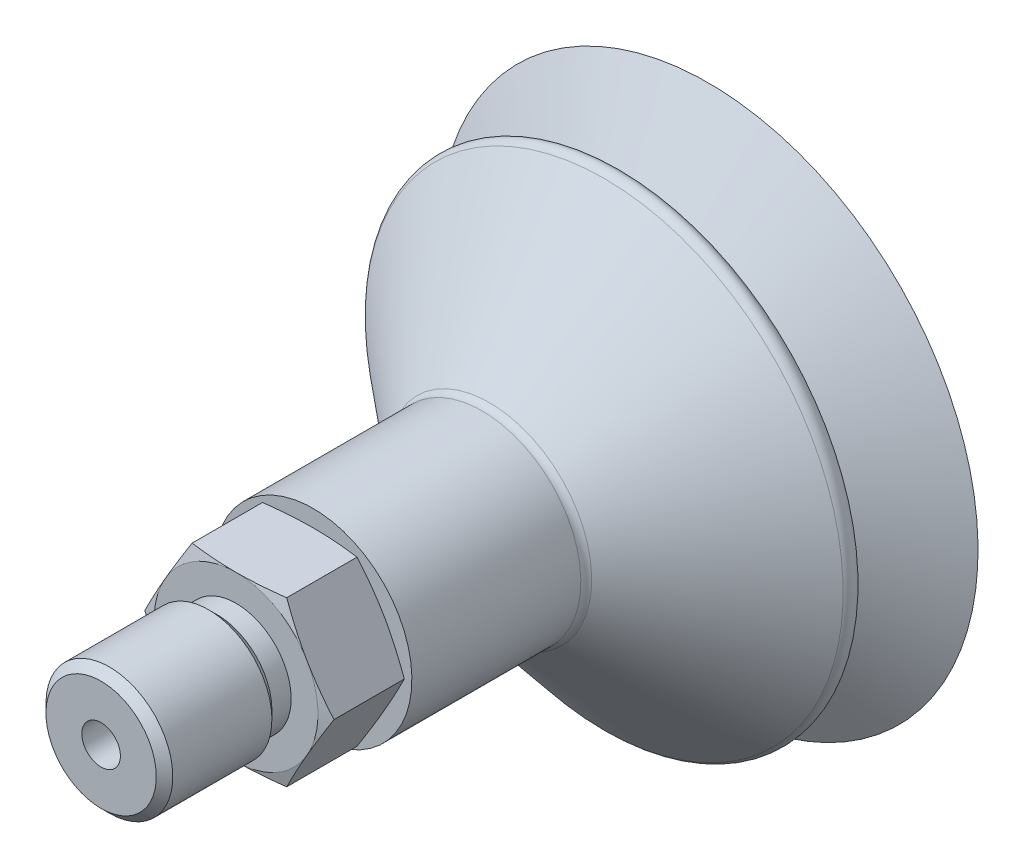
ISO-10303-21;
HEADER;
FILE_DESCRIPTION(('STEP AP214'),'2;1');
FILE_NAME('part.step','',(''),(''),'','','');
FILE_SCHEMA(('AUTOMOTIVE_DESIGN { 1 0 10303 214 1 1 1 1 }'));
ENDSEC;
DATA;
#1=APPLICATION_CONTEXT('core data for automotive mechanical design processes');
#2=APPLICATION_PROTOCOL_DEFINITION('international standard','automotive_design',2000,#1);
#3=PRODUCT_CONTEXT('',#1,'mechanical');
#4=PRODUCT('Part','Part','',(#3));
#5=PRODUCT_RELATED_PRODUCT_CATEGORY('part','',(#4));
#6=PRODUCT_DEFINITION_FORMATION('','',#4);
#7=PRODUCT_DEFINITION_CONTEXT('part definition',#1,'design');
#8=PRODUCT_DEFINITION('design','',#6,#7);
#9=PRODUCT_DEFINITION_SHAPE('','',#8);
#10=(LENGTH_UNIT() NAMED_UNIT(*) SI_UNIT(.MILLI.,.METRE.));
#11=(NAMED_UNIT(*) PLANE_ANGLE_UNIT() SI_UNIT($,.RADIAN.));
#12=(NAMED_UNIT(*) SI_UNIT($,.STERADIAN.) SOLID_ANGLE_UNIT());
#13=UNCERTAINTY_MEASURE_WITH_UNIT(LENGTH_MEASURE(1.E-05),#10,'distance_accuracy_value','');
#14=(GEOMETRIC_REPRESENTATION_CONTEXT(3) GLOBAL_UNCERTAINTY_ASSIGNED_CONTEXT((#13)) GLOBAL_UNIT_ASSIGNED_CONTEXT((#10,
#11,#12)) REPRESENTATION_CONTEXT('',''));
#15=CARTESIAN_POINT('',(0.,0.,0.));
#16=DIRECTION('',(0.,0.,1.));
#17=DIRECTION('',(1.,0.,0.));
#18=AXIS2_PLACEMENT_3D('',#15,#16,#17);
#19=CARTESIAN_POINT('',(9.81495457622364,0.,49.));
#20=DIRECTION('',(-0.866025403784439,-0.5,0.));
#21=DIRECTION('',(0.,0.,-1.));
#22=AXIS2_PLACEMENT_3D('',#19,#20,#21);
#23=PLANE('',#22);
#24=CARTESIAN_POINT('',(9.81495457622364,0.,41.3523410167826));
#25=CARTESIAN_POINT('',(8.50000000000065,2.27756813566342,41.));
#26=CARTESIAN_POINT('',(7.36121593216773,4.25,41.));
#27=B_SPLINE_CURVE_WITH_KNOTS('',2,(#24,#25,#26),.UNSPECIFIED.,.F.,.F.,(3,3),(0.,1.),.UNSPECIFIED.);
#28=CARTESIAN_POINT('',(9.81495457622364,0.,41.3523410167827));
#29=VERTEX_POINT('',#28);
#30=CARTESIAN_POINT('',(7.36121593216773,4.25,41.));
#31=VERTEX_POINT('',#30);
#32=EDGE_CURVE('E375',#29,#31,#27,.T.);
#33=ORIENTED_EDGE('',*,*,#32,.T.);
#34=CARTESIAN_POINT('',(7.36121593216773,4.25,41.));
#35=CARTESIAN_POINT('',(6.22243186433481,6.22243186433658,41.));
#36=CARTESIAN_POINT('',(4.90747728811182,8.5,41.3523410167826));
#37=B_SPLINE_CURVE_WITH_KNOTS('',2,(#34,#35,#36),.UNSPECIFIED.,.F.,.F.,(3,3),(0.,1.),.UNSPECIFIED.);
#38=CARTESIAN_POINT('',(4.90747728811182,8.5,41.3523410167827));
#39=VERTEX_POINT('',#38);
#40=EDGE_CURVE('E1022',#31,#39,#37,.T.);
#41=ORIENTED_EDGE('',*,*,#40,.T.);
#42=DIRECTION('',(0.,0.,-1.));
#43=VECTOR('',#42,1.);
#44=CARTESIAN_POINT('',(4.90747728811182,8.5,49.));
#45=LINE('',#44,#43);
#46=CARTESIAN_POINT('',(4.90747728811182,8.5,48.6476589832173));
#47=VERTEX_POINT('',#46);
#48=EDGE_CURVE('E10',#47,#39,#45,.T.);
#49=ORIENTED_EDGE('',*,*,#48,.F.);
#50=CARTESIAN_POINT('',(4.90747728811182,8.5,48.6476589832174));
#51=CARTESIAN_POINT('',(6.22243186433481,6.22243186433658,49.));
#52=CARTESIAN_POINT('',(7.36121593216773,4.25,49.));
#53=B_SPLINE_CURVE_WITH_KNOTS('',2,(#50,#51,#52),.UNSPECIFIED.,.F.,.F.,(3,3),(0.,1.),.UNSPECIFIED.);
#54=CARTESIAN_POINT('',(7.36121593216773,4.25,49.));
#55=VERTEX_POINT('',#54);
#56=EDGE_CURVE('E228',#47,#55,#53,.T.);
#57=ORIENTED_EDGE('',*,*,#56,.T.);
#58=CARTESIAN_POINT('',(7.36121593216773,4.25,49.));
#59=CARTESIAN_POINT('',(8.50000000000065,2.27756813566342,49.));
#60=CARTESIAN_POINT('',(9.81495457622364,0.,48.6476589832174));
#61=B_SPLINE_CURVE_WITH_KNOTS('',2,(#58,#59,#60),.UNSPECIFIED.,.F.,.F.,(3,3),(0.,1.),.UNSPECIFIED.);
#62=CARTESIAN_POINT('',(9.81495457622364,0.,48.6476589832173));
#63=VERTEX_POINT('',#62);
#64=EDGE_CURVE('E337',#55,#63,#61,.T.);
#65=ORIENTED_EDGE('',*,*,#64,.T.);
#66=DIRECTION('',(0.,0.,-1.));
#67=VECTOR('',#66,1.);
#68=CARTESIAN_POINT('',(9.81495457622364,0.,49.));
#69=LINE('',#68,#67);
#70=EDGE_CURVE('E275',#63,#29,#69,.T.);
#71=ORIENTED_EDGE('',*,*,#70,.T.);
#72=EDGE_LOOP('',(#33,#41,#49,#57,#65,#71));
#73=FACE_BOUND('',#72,.T.);
#74=ADVANCED_FACE('F15',(#73),#23,.F.);
#75=CARTESIAN_POINT('',(4.90747728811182,8.5,49.));
#76=DIRECTION('',(0.,-1.,0.));
#77=DIRECTION('',(0.,0.,-1.));
#78=AXIS2_PLACEMENT_3D('',#75,#76,#77);
#79=PLANE('',#78);
#80=CARTESIAN_POINT('',(4.90747728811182,8.5,41.3523410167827));
#81=CARTESIAN_POINT('',(2.27756813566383,8.5,41.));
#82=CARTESIAN_POINT('',(0.,8.5,41.));
#83=B_SPLINE_CURVE_WITH_KNOTS('',2,(#80,#81,#82),.UNSPECIFIED.,.F.,.F.,(3,3),(0.,1.),.UNSPECIFIED.);
#84=CARTESIAN_POINT('',(0.,8.5,41.));
#85=VERTEX_POINT('',#84);
#86=EDGE_CURVE('E248',#39,#85,#83,.T.);
#87=ORIENTED_EDGE('',*,*,#86,.T.);
#88=CARTESIAN_POINT('',(0.,8.5,41.));
#89=CARTESIAN_POINT('',(-2.27756813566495,8.5,41.));
#90=CARTESIAN_POINT('',(-4.90747728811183,8.5,41.3523410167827));
#91=B_SPLINE_CURVE_WITH_KNOTS('',2,(#88,#89,#90),.UNSPECIFIED.,.F.,.F.,(3,3),(0.,1.),.UNSPECIFIED.);
#92=CARTESIAN_POINT('',(-4.90747728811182,8.5,41.3523410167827));
#93=VERTEX_POINT('',#92);
#94=EDGE_CURVE('E431',#85,#93,#91,.T.);
#95=ORIENTED_EDGE('',*,*,#94,.T.);
#96=DIRECTION('',(0.,0.,-1.));
#97=VECTOR('',#96,1.);
#98=CARTESIAN_POINT('',(-4.90747728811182,8.5,49.));
#99=LINE('',#98,#97);
#100=CARTESIAN_POINT('',(-4.90747728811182,8.5,48.6476589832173));
#101=VERTEX_POINT('',#100);
#102=EDGE_CURVE('E28',#101,#93,#99,.T.);
#103=ORIENTED_EDGE('',*,*,#102,.F.);
#104=CARTESIAN_POINT('',(-4.90747728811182,8.5,48.6476589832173));
#105=CARTESIAN_POINT('',(-2.27756813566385,8.5,49.));
#106=CARTESIAN_POINT('',(0.,8.5,49.));
#107=B_SPLINE_CURVE_WITH_KNOTS('',2,(#104,#105,#106),.UNSPECIFIED.,.F.,.F.,(3,3),(0.,1.),.UNSPECIFIED.);
#108=CARTESIAN_POINT('',(0.,8.5,49.));
#109=VERTEX_POINT('',#108);
#110=EDGE_CURVE('E269',#101,#109,#107,.T.);
#111=ORIENTED_EDGE('',*,*,#110,.T.);
#112=CARTESIAN_POINT('',(0.,8.5,49.));
#113=CARTESIAN_POINT('',(2.27756813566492,8.5,49.));
#114=CARTESIAN_POINT('',(4.90747728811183,8.5,48.6476589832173));
#115=B_SPLINE_CURVE_WITH_KNOTS('',2,(#112,#113,#114),.UNSPECIFIED.,.F.,.F.,(3,3),(0.,1.),.UNSPECIFIED.);
#116=EDGE_CURVE('E1023',#109,#47,#115,.T.);
#117=ORIENTED_EDGE('',*,*,#116,.T.);
#118=ORIENTED_EDGE('',*,*,#48,.T.);
#119=EDGE_LOOP('',(#87,#95,#103,#111,#117,#118));
#120=FACE_BOUND('',#119,.T.);
#121=ADVANCED_FACE('F306',(#120),#79,.F.);
#122=CARTESIAN_POINT('',(-4.90747728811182,8.5,49.));
#123=DIRECTION('',(0.866025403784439,-0.5,0.));
#124=DIRECTION('',(0.5,0.866025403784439,0.));
#125=AXIS2_PLACEMENT_3D('',#122,#123,#124);
#126=PLANE('',#125);
#127=CARTESIAN_POINT('',(-4.90747728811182,8.5,41.3523410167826));
#128=CARTESIAN_POINT('',(-6.22243186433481,6.22243186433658,41.));
#129=CARTESIAN_POINT('',(-7.36121593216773,4.25,41.));
#130=B_SPLINE_CURVE_WITH_KNOTS('',2,(#127,#128,#129),.UNSPECIFIED.,.F.,.F.,(3,3),(0.,1.),.UNSPECIFIED.);
#131=CARTESIAN_POINT('',(-7.36121593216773,4.25,41.));
#132=VERTEX_POINT('',#131);
#133=EDGE_CURVE('E681',#93,#132,#130,.T.);
#134=ORIENTED_EDGE('',*,*,#133,.T.);
#135=CARTESIAN_POINT('',(-7.36121593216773,4.25,41.));
#136=CARTESIAN_POINT('',(-8.50000000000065,2.27756813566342,41.));
#137=CARTESIAN_POINT('',(-9.81495457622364,0.,41.3523410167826));
#138=B_SPLINE_CURVE_WITH_KNOTS('',2,(#135,#136,#137),.UNSPECIFIED.,.F.,.F.,(3,3),(0.,1.),.UNSPECIFIED.);
#139=CARTESIAN_POINT('',(-9.81495457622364,0.,41.3523410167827));
#140=VERTEX_POINT('',#139);
#141=EDGE_CURVE('E808',#132,#140,#138,.T.);
#142=ORIENTED_EDGE('',*,*,#141,.T.);
#143=DIRECTION('',(0.,0.,-1.));
#144=VECTOR('',#143,1.);
#145=CARTESIAN_POINT('',(-9.81495457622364,0.,49.));
#146=LINE('',#145,#144);
#147=CARTESIAN_POINT('',(-9.81495457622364,0.,48.6476589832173));
#148=VERTEX_POINT('',#147);
#149=EDGE_CURVE('E820',#148,#140,#146,.T.);
#150=ORIENTED_EDGE('',*,*,#149,.F.);
#151=CARTESIAN_POINT('',(-9.81495457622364,0.,48.6476589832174));
#152=CARTESIAN_POINT('',(-8.50000000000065,2.27756813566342,49.));
#153=CARTESIAN_POINT('',(-7.36121593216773,4.25,49.));
#154=B_SPLINE_CURVE_WITH_KNOTS('',2,(#151,#152,#153),.UNSPECIFIED.,.F.,.F.,(3,3),(0.,1.),.UNSPECIFIED.);
#155=CARTESIAN_POINT('',(-7.36121593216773,4.25,49.));
#156=VERTEX_POINT('',#155);
#157=EDGE_CURVE('E881',#148,#156,#154,.T.);
#158=ORIENTED_EDGE('',*,*,#157,.T.);
#159=CARTESIAN_POINT('',(-7.36121593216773,4.25,49.));
#160=CARTESIAN_POINT('',(-6.22243186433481,6.22243186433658,49.));
#161=CARTESIAN_POINT('',(-4.90747728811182,8.5,48.6476589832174));
#162=B_SPLINE_CURVE_WITH_KNOTS('',2,(#159,#160,#161),.UNSPECIFIED.,.F.,.F.,(3,3),(0.,1.),.UNSPECIFIED.);
#163=EDGE_CURVE('E522',#156,#101,#162,.T.);
#164=ORIENTED_EDGE('',*,*,#163,.T.);
#165=ORIENTED_EDGE('',*,*,#102,.T.);
#166=EDGE_LOOP('',(#134,#142,#150,#158,#164,#165));
#167=FACE_BOUND('',#166,.T.);
#168=ADVANCED_FACE('F447',(#167),#126,.F.);
#169=CARTESIAN_POINT('',(-9.81495457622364,0.,49.));
#170=DIRECTION('',(0.866025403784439,0.5,0.));
#171=DIRECTION('',(0.,0.,1.));
#172=AXIS2_PLACEMENT_3D('',#169,#170,#171);
#173=PLANE('',#172);
#174=CARTESIAN_POINT('',(-9.81495457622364,0.,41.3523410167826));
#175=CARTESIAN_POINT('',(-8.50000000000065,-2.27756813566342,41.));
#176=CARTESIAN_POINT('',(-7.36121593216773,-4.25,41.));
#177=B_SPLINE_CURVE_WITH_KNOTS('',2,(#174,#175,#176),.UNSPECIFIED.,.F.,.F.,(3,3),(0.,1.),.UNSPECIFIED.);
#178=CARTESIAN_POINT('',(-7.36121593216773,-4.25,41.));
#179=VERTEX_POINT('',#178);
#180=EDGE_CURVE('E575',#140,#179,#177,.T.);
#181=ORIENTED_EDGE('',*,*,#180,.T.);
#182=CARTESIAN_POINT('',(-7.36121593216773,-4.25,41.));
#183=CARTESIAN_POINT('',(-6.22243186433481,-6.22243186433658,41.));
#184=CARTESIAN_POINT('',(-4.90747728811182,-8.5,41.3523410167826));
#185=B_SPLINE_CURVE_WITH_KNOTS('',2,(#182,#183,#184),.UNSPECIFIED.,.F.,.F.,(3,3),(0.,1.),.UNSPECIFIED.);
#186=CARTESIAN_POINT('',(-4.90747728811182,-8.5,41.3523410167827));
#187=VERTEX_POINT('',#186);
#188=EDGE_CURVE('E804',#179,#187,#185,.T.);
#189=ORIENTED_EDGE('',*,*,#188,.T.);
#190=DIRECTION('',(0.,0.,-1.));
#191=VECTOR('',#190,1.);
#192=CARTESIAN_POINT('',(-4.90747728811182,-8.5,49.));
#193=LINE('',#192,#191);
#194=CARTESIAN_POINT('',(-4.90747728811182,-8.5,48.6476589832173));
#195=VERTEX_POINT('',#194);
#196=EDGE_CURVE('E811',#195,#187,#193,.T.);
#197=ORIENTED_EDGE('',*,*,#196,.F.);
#198=CARTESIAN_POINT('',(-4.90747728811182,-8.5,48.6476589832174));
#199=CARTESIAN_POINT('',(-6.22243186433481,-6.22243186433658,49.));
#200=CARTESIAN_POINT('',(-7.36121593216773,-4.25,49.));
#201=B_SPLINE_CURVE_WITH_KNOTS('',2,(#198,#199,#200),.UNSPECIFIED.,.F.,.F.,(3,3),(0.,1.),.UNSPECIFIED.);
#202=CARTESIAN_POINT('',(-7.36121593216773,-4.25,49.));
#203=VERTEX_POINT('',#202);
#204=EDGE_CURVE('E904',#195,#203,#201,.T.);
#205=ORIENTED_EDGE('',*,*,#204,.T.);
#206=CARTESIAN_POINT('',(-7.36121593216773,-4.25,49.));
#207=CARTESIAN_POINT('',(-8.50000000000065,-2.27756813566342,49.));
#208=CARTESIAN_POINT('',(-9.81495457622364,0.,48.6476589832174));
#209=B_SPLINE_CURVE_WITH_KNOTS('',2,(#206,#207,#208),.UNSPECIFIED.,.F.,.F.,(3,3),(0.,1.),.UNSPECIFIED.);
#210=EDGE_CURVE('E523',#203,#148,#209,.T.);
#211=ORIENTED_EDGE('',*,*,#210,.T.);
#212=ORIENTED_EDGE('',*,*,#149,.T.);
#213=EDGE_LOOP('',(#181,#189,#197,#205,#211,#212));
#214=FACE_BOUND('',#213,.T.);
#215=ADVANCED_FACE('F537',(#214),#173,.F.);
#216=CARTESIAN_POINT('',(-4.90747728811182,-8.5,49.));
#217=DIRECTION('',(0.,1.,0.));
#218=DIRECTION('',(-1.,0.,0.));
#219=AXIS2_PLACEMENT_3D('',#216,#217,#218);
#220=PLANE('',#219);
#221=CARTESIAN_POINT('',(-4.90747728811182,-8.5,41.3523410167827));
#222=CARTESIAN_POINT('',(-2.27756813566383,-8.5,41.));
#223=CARTESIAN_POINT('',(0.,-8.5,41.));
#224=B_SPLINE_CURVE_WITH_KNOTS('',2,(#221,#222,#223),.UNSPECIFIED.,.F.,.F.,(3,3),(0.,1.),.UNSPECIFIED.);
#225=CARTESIAN_POINT('',(0.,-8.5,41.));
#226=VERTEX_POINT('',#225);
#227=EDGE_CURVE('E611',#187,#226,#224,.T.);
#228=ORIENTED_EDGE('',*,*,#227,.T.);
#229=CARTESIAN_POINT('',(0.,-8.5,41.));
#230=CARTESIAN_POINT('',(2.27756813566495,-8.5,41.));
#231=CARTESIAN_POINT('',(4.90747728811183,-8.5,41.3523410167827));
#232=B_SPLINE_CURVE_WITH_KNOTS('',2,(#229,#230,#231),.UNSPECIFIED.,.F.,.F.,(3,3),(0.,1.),.UNSPECIFIED.);
#233=CARTESIAN_POINT('',(4.90747728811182,-8.5,41.3523410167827));
#234=VERTEX_POINT('',#233);
#235=EDGE_CURVE('E423',#226,#234,#232,.T.);
#236=ORIENTED_EDGE('',*,*,#235,.T.);
#237=DIRECTION('',(0.,0.,-1.));
#238=VECTOR('',#237,1.);
#239=CARTESIAN_POINT('',(4.90747728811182,-8.5,49.));
#240=LINE('',#239,#238);
#241=CARTESIAN_POINT('',(4.90747728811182,-8.5,48.6476589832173));
#242=VERTEX_POINT('',#241);
#243=EDGE_CURVE('E699',#242,#234,#240,.T.);
#244=ORIENTED_EDGE('',*,*,#243,.F.);
#245=CARTESIAN_POINT('',(4.90747728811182,-8.5,48.6476589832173));
#246=CARTESIAN_POINT('',(2.27756813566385,-8.5,49.));
#247=CARTESIAN_POINT('',(0.,-8.5,49.));
#248=B_SPLINE_CURVE_WITH_KNOTS('',2,(#245,#246,#247),.UNSPECIFIED.,.F.,.F.,(3,3),(0.,1.),.UNSPECIFIED.);
#249=CARTESIAN_POINT('',(0.,-8.5,49.));
#250=VERTEX_POINT('',#249);
#251=EDGE_CURVE('E949',#242,#250,#248,.T.);
#252=ORIENTED_EDGE('',*,*,#251,.T.);
#253=CARTESIAN_POINT('',(0.,-8.5,49.));
#254=CARTESIAN_POINT('',(-2.27756813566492,-8.5,49.));
#255=CARTESIAN_POINT('',(-4.90747728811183,-8.5,48.6476589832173));
#256=B_SPLINE_CURVE_WITH_KNOTS('',2,(#253,#254,#255),.UNSPECIFIED.,.F.,.F.,(3,3),(0.,1.),.UNSPECIFIED.);
#257=EDGE_CURVE('E905',#250,#195,#256,.T.);
#258=ORIENTED_EDGE('',*,*,#257,.T.);
#259=ORIENTED_EDGE('',*,*,#196,.T.);
#260=EDGE_LOOP('',(#228,#236,#244,#252,#258,#259));
#261=FACE_BOUND('',#260,.T.);
#262=ADVANCED_FACE('F448',(#261),#220,.F.);
#263=CARTESIAN_POINT('',(4.90747728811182,-8.5,49.));
#264=DIRECTION('',(-0.866025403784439,0.5,0.));
#265=DIRECTION('',(0.,0.,-1.));
#266=AXIS2_PLACEMENT_3D('',#263,#264,#265);
#267=PLANE('',#266);
#268=CARTESIAN_POINT('',(4.90747728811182,-8.5,41.3523410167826));
#269=CARTESIAN_POINT('',(6.22243186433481,-6.22243186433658,41.));
#270=CARTESIAN_POINT('',(7.36121593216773,-4.25,41.));
#271=B_SPLINE_CURVE_WITH_KNOTS('',2,(#268,#269,#270),.UNSPECIFIED.,.F.,.F.,(3,3),(0.,1.),.UNSPECIFIED.);
#272=CARTESIAN_POINT('',(7.36121593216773,-4.25,41.));
#273=VERTEX_POINT('',#272);
#274=EDGE_CURVE('E422',#234,#273,#271,.T.);
#275=ORIENTED_EDGE('',*,*,#274,.T.);
#276=CARTESIAN_POINT('',(7.36121593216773,-4.25,41.));
#277=CARTESIAN_POINT('',(8.50000000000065,-2.27756813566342,41.));
#278=CARTESIAN_POINT('',(9.81495457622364,0.,41.3523410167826));
#279=B_SPLINE_CURVE_WITH_KNOTS('',2,(#276,#277,#278),.UNSPECIFIED.,.F.,.F.,(3,3),(0.,1.),.UNSPECIFIED.);
#280=EDGE_CURVE('E400',#273,#29,#279,.T.);
#281=ORIENTED_EDGE('',*,*,#280,.T.);
#282=ORIENTED_EDGE('',*,*,#70,.F.);
#283=CARTESIAN_POINT('',(9.81495457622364,0.,48.6476589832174));
#284=CARTESIAN_POINT('',(8.50000000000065,-2.27756813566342,49.));
#285=CARTESIAN_POINT('',(7.36121593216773,-4.25,49.));
#286=B_SPLINE_CURVE_WITH_KNOTS('',2,(#283,#284,#285),.UNSPECIFIED.,.F.,.F.,(3,3),(0.,1.),.UNSPECIFIED.);
#287=CARTESIAN_POINT('',(7.36121593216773,-4.25,49.));
#288=VERTEX_POINT('',#287);
#289=EDGE_CURVE('E996',#63,#288,#286,.T.);
#290=ORIENTED_EDGE('',*,*,#289,.T.);
#291=CARTESIAN_POINT('',(7.36121593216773,-4.25,49.));
#292=CARTESIAN_POINT('',(6.22243186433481,-6.22243186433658,49.));
#293=CARTESIAN_POINT('',(4.90747728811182,-8.5,48.6476589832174));
#294=B_SPLINE_CURVE_WITH_KNOTS('',2,(#291,#292,#293),.UNSPECIFIED.,.F.,.F.,(3,3),(0.,1.),.UNSPECIFIED.);
#295=EDGE_CURVE('E950',#288,#242,#294,.T.);
#296=ORIENTED_EDGE('',*,*,#295,.T.);
#297=ORIENTED_EDGE('',*,*,#243,.T.);
#298=EDGE_LOOP('',(#275,#281,#282,#290,#296,#297));
#299=FACE_BOUND('',#298,.T.);
#300=ADVANCED_FACE('F309',(#299),#267,.F.);
#301=CARTESIAN_POINT('',(0.,0.,62.144));
#302=DIRECTION('',(0.,0.,-1.));
#303=DIRECTION('',(0.,-1.,0.));
#304=AXIS2_PLACEMENT_3D('',#301,#302,#303);
#305=CONICAL_SURFACE('',#304,6.5785,0.785398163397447);
#306=CARTESIAN_POINT('',(0.,0.,62.144));
#307=DIRECTION('',(0.,0.,-1.));
#308=DIRECTION('',(0.,-1.,0.));
#309=AXIS2_PLACEMENT_3D('',#306,#307,#308);
#310=CIRCLE('',#309,6.5785);
#311=CARTESIAN_POINT('',(0.,-6.5785,62.144));
#312=VERTEX_POINT('',#311);
#313=EDGE_CURVE('E40',#312,#312,#310,.T.);
#314=ORIENTED_EDGE('',*,*,#313,.F.);
#315=EDGE_LOOP('',(#314));
#316=FACE_BOUND('',#315,.T.);
#317=CARTESIAN_POINT('',(0.,0.,63.));
#318=DIRECTION('',(0.,0.,-1.));
#319=DIRECTION('',(0.,-1.,0.));
#320=AXIS2_PLACEMENT_3D('',#317,#318,#319);
#321=CIRCLE('',#320,5.7225);
#322=CARTESIAN_POINT('',(0.,-5.7225,63.));
#323=VERTEX_POINT('',#322);
#324=EDGE_CURVE('E245',#323,#323,#321,.T.);
#325=ORIENTED_EDGE('',*,*,#324,.T.);
#326=EDGE_LOOP('',(#325));
#327=FACE_BOUND('',#326,.T.);
#328=ADVANCED_FACE('F1582',(#316,#327),#305,.T.);
#329=CARTESIAN_POINT('',(0.,0.,41.));
#330=DIRECTION('',(0.,0.,-1.));
#331=DIRECTION('',(0.,-1.,0.));
#332=AXIS2_PLACEMENT_3D('',#329,#330,#331);
#333=CYLINDRICAL_SURFACE('',#332,6.5785);
#334=CARTESIAN_POINT('',(0.,0.,51.856));
#335=DIRECTION('',(0.,0.,-1.));
#336=DIRECTION('',(0.,-1.,0.));
#337=AXIS2_PLACEMENT_3D('',#334,#335,#336);
#338=CIRCLE('',#337,6.5785);
#339=CARTESIAN_POINT('',(0.,-6.5785,51.856));
#340=VERTEX_POINT('',#339);
#341=EDGE_CURVE('E253',#340,#340,#338,.T.);
#342=ORIENTED_EDGE('',*,*,#341,.F.);
#343=EDGE_LOOP('',(#342));
#344=FACE_BOUND('',#343,.T.);
#345=ORIENTED_EDGE('',*,*,#313,.T.);
#346=EDGE_LOOP('',(#345));
#347=FACE_BOUND('',#346,.T.);
#348=ADVANCED_FACE('F786',(#344,#347),#333,.T.);
#349=CARTESIAN_POINT('',(0.,0.,51.));
#350=DIRECTION('',(0.,0.,1.));
#351=DIRECTION('',(0.,1.,0.));
#352=AXIS2_PLACEMENT_3D('',#349,#350,#351);
#353=CONICAL_SURFACE('',#352,5.7225,0.785398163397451);
#354=CARTESIAN_POINT('',(0.,0.,51.));
#355=DIRECTION('',(0.,0.,-1.));
#356=DIRECTION('',(0.,-1.,0.));
#357=AXIS2_PLACEMENT_3D('',#354,#355,#356);
#358=CIRCLE('',#357,5.7225);
#359=CARTESIAN_POINT('',(0.,-5.7225,51.));
#360=VERTEX_POINT('',#359);
#361=EDGE_CURVE('E227',#360,#360,#358,.T.);
#362=ORIENTED_EDGE('',*,*,#361,.F.);
#363=EDGE_LOOP('',(#362));
#364=FACE_BOUND('',#363,.T.);
#365=ORIENTED_EDGE('',*,*,#341,.T.);
#366=EDGE_LOOP('',(#365));
#367=FACE_BOUND('',#366,.T.);
#368=ADVANCED_FACE('F1563',(#364,#367),#353,.T.);
#369=CARTESIAN_POINT('',(0.,0.,41.));
#370=DIRECTION('',(0.,0.,-1.));
#371=DIRECTION('',(0.,-1.,0.));
#372=AXIS2_PLACEMENT_3D('',#369,#370,#371);
#373=CYLINDRICAL_SURFACE('',#372,5.7225);
#374=CARTESIAN_POINT('',(0.,0.,49.));
#375=DIRECTION('',(0.,0.,-1.));
#376=DIRECTION('',(0.,-1.,0.));
#377=AXIS2_PLACEMENT_3D('',#374,#375,#376);
#378=CIRCLE('',#377,5.7225);
#379=CARTESIAN_POINT('',(0.,-5.7225,49.));
#380=VERTEX_POINT('',#379);
#381=EDGE_CURVE('E224',#380,#380,#378,.T.);
#382=ORIENTED_EDGE('',*,*,#381,.F.);
#383=EDGE_LOOP('',(#382));
#384=FACE_BOUND('',#383,.T.);
#385=ORIENTED_EDGE('',*,*,#361,.T.);
#386=EDGE_LOOP('',(#385));
#387=FACE_BOUND('',#386,.T.);
#388=ADVANCED_FACE('F1553',(#384,#387),#373,.T.);
#389=CARTESIAN_POINT('',(-8.5,0.,49.));
#390=DIRECTION('',(0.,0.,1.));
#391=DIRECTION('',(-1.,0.,0.));
#392=AXIS2_PLACEMENT_3D('',#389,#390,#391);
#393=PLANE('',#392);
#394=CARTESIAN_POINT('',(0.,0.,49.));
#395=DIRECTION('',(0.,0.,-1.));
#396=DIRECTION('',(0.,-1.,0.));
#397=AXIS2_PLACEMENT_3D('',#394,#395,#396);
#398=CIRCLE('',#397,8.5);
#399=EDGE_CURVE('E513',#203,#156,#398,.T.);
#400=ORIENTED_EDGE('',*,*,#399,.F.);
#401=CARTESIAN_POINT('',(0.,0.,49.));
#402=DIRECTION('',(0.,0.,-1.));
#403=DIRECTION('',(0.,-1.,0.));
#404=AXIS2_PLACEMENT_3D('',#401,#402,#403);
#405=CIRCLE('',#404,8.5);
#406=EDGE_CURVE('E895',#250,#203,#405,.T.);
#407=ORIENTED_EDGE('',*,*,#406,.F.);
#408=CARTESIAN_POINT('',(0.,0.,49.));
#409=DIRECTION('',(0.,0.,-1.));
#410=DIRECTION('',(0.,-1.,0.));
#411=AXIS2_PLACEMENT_3D('',#408,#409,#410);
#412=CIRCLE('',#411,8.5);
#413=EDGE_CURVE('E940',#288,#250,#412,.T.);
#414=ORIENTED_EDGE('',*,*,#413,.F.);
#415=CARTESIAN_POINT('',(0.,0.,49.));
#416=DIRECTION('',(0.,0.,-1.));
#417=DIRECTION('',(0.,-1.,0.));
#418=AXIS2_PLACEMENT_3D('',#415,#416,#417);
#419=CIRCLE('',#418,8.5);
#420=EDGE_CURVE('E994',#55,#288,#419,.T.);
#421=ORIENTED_EDGE('',*,*,#420,.F.);
#422=CARTESIAN_POINT('',(0.,0.,49.));
#423=DIRECTION('',(0.,0.,-1.));
#424=DIRECTION('',(0.,-1.,0.));
#425=AXIS2_PLACEMENT_3D('',#422,#423,#424);
#426=CIRCLE('',#425,8.5);
#427=EDGE_CURVE('E1025',#109,#55,#426,.T.);
#428=ORIENTED_EDGE('',*,*,#427,.F.);
#429=CARTESIAN_POINT('',(0.,0.,49.));
#430=DIRECTION('',(0.,0.,-1.));
#431=DIRECTION('',(0.,-1.,0.));
#432=AXIS2_PLACEMENT_3D('',#429,#430,#431);
#433=CIRCLE('',#432,8.5);
#434=EDGE_CURVE('E1080',#156,#109,#433,.T.);
#435=ORIENTED_EDGE('',*,*,#434,.F.);
#436=EDGE_LOOP('',(#400,#407,#414,#421,#428,#435));
#437=FACE_BOUND('',#436,.T.);
#438=ORIENTED_EDGE('',*,*,#381,.T.);
#439=EDGE_LOOP('',(#438));
#440=FACE_BOUND('',#439,.T.);
#441=ADVANCED_FACE('F654',(#437,#440),#393,.T.);
#442=CARTESIAN_POINT('',(0.,0.,48.5444863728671));
#443=DIRECTION('',(0.,0.,-1.));
#444=DIRECTION('',(0.,-1.,0.));
#445=AXIS2_PLACEMENT_3D('',#442,#443,#444);
#446=CONICAL_SURFACE('',#445,10.2,1.30899693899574);
#447=ORIENTED_EDGE('',*,*,#116,.F.);
#448=ORIENTED_EDGE('',*,*,#427,.T.);
#449=ORIENTED_EDGE('',*,*,#56,.F.);
#450=EDGE_LOOP('',(#447,#448,#449));
#451=FACE_BOUND('',#450,.T.);
#452=ADVANCED_FACE('F592',(#451),#446,.T.);
#453=CARTESIAN_POINT('',(0.,0.,41.));
#454=DIRECTION('',(0.,0.,1.));
#455=DIRECTION('',(0.,1.,0.));
#456=AXIS2_PLACEMENT_3D('',#453,#454,#455);
#457=CONICAL_SURFACE('',#456,8.5,1.30899693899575);
#458=ORIENTED_EDGE('',*,*,#86,.F.);
#459=ORIENTED_EDGE('',*,*,#40,.F.);
#460=CARTESIAN_POINT('',(0.,0.,41.));
#461=DIRECTION('',(0.,0.,-1.));
#462=DIRECTION('',(0.,-1.,0.));
#463=AXIS2_PLACEMENT_3D('',#460,#461,#462);
#464=CIRCLE('',#463,8.5);
#465=EDGE_CURVE('E207',#85,#31,#464,.T.);
#466=ORIENTED_EDGE('',*,*,#465,.F.);
#467=EDGE_LOOP('',(#458,#459,#466));
#468=FACE_BOUND('',#467,.T.);
#469=ADVANCED_FACE('F648',(#468),#457,.T.);
#470=CARTESIAN_POINT('',(0.,0.,41.));
#471=DIRECTION('',(0.,0.,-1.));
#472=DIRECTION('',(0.,-1.,0.));
#473=AXIS2_PLACEMENT_3D('',#470,#471,#472);
#474=CYLINDRICAL_SURFACE('',#473,2.);
#475=CARTESIAN_POINT('',(0.,0.,63.));
#476=DIRECTION('',(0.,0.,-1.));
#477=DIRECTION('',(0.,-1.,0.));
#478=AXIS2_PLACEMENT_3D('',#475,#476,#477);
#479=CIRCLE('',#478,2.);
#480=CARTESIAN_POINT('',(0.,-2.,63.));
#481=VERTEX_POINT('',#480);
#482=EDGE_CURVE('E249',#481,#481,#479,.T.);
#483=ORIENTED_EDGE('',*,*,#482,.F.);
#484=EDGE_LOOP('',(#483));
#485=FACE_BOUND('',#484,.T.);
#486=CARTESIAN_POINT('',(0.,0.,41.));
#487=DIRECTION('',(0.,0.,-1.));
#488=DIRECTION('',(0.,-1.,0.));
#489=AXIS2_PLACEMENT_3D('',#486,#487,#488);
#490=CIRCLE('',#489,2.);
#491=CARTESIAN_POINT('',(0.,-2.,41.));
#492=VERTEX_POINT('',#491);
#493=EDGE_CURVE('E216',#492,#492,#490,.T.);
#494=ORIENTED_EDGE('',*,*,#493,.T.);
#495=EDGE_LOOP('',(#494));
#496=FACE_BOUND('',#495,.T.);
#497=ADVANCED_FACE('F645',(#485,#496),#474,.F.);
#498=CARTESIAN_POINT('',(-5.7225,0.,63.));
#499=DIRECTION('',(0.,0.,1.));
#500=DIRECTION('',(-1.,0.,0.));
#501=AXIS2_PLACEMENT_3D('',#498,#499,#500);
#502=PLANE('',#501);
#503=ORIENTED_EDGE('',*,*,#324,.F.);
#504=EDGE_LOOP('',(#503));
#505=FACE_BOUND('',#504,.T.);
#506=ORIENTED_EDGE('',*,*,#482,.T.);
#507=EDGE_LOOP('',(#506));
#508=FACE_BOUND('',#507,.T.);
#509=ADVANCED_FACE('F549',(#505,#508),#502,.T.);
#510=CARTESIAN_POINT('',(-2.,0.,41.));
#511=DIRECTION('',(0.,0.,-1.));
#512=DIRECTION('',(0.,-1.,0.));
#513=AXIS2_PLACEMENT_3D('',#510,#511,#512);
#514=PLANE('',#513);
#515=ORIENTED_EDGE('',*,*,#493,.F.);
#516=EDGE_LOOP('',(#515));
#517=FACE_BOUND('',#516,.T.);
#518=CARTESIAN_POINT('',(0.,0.,41.));
#519=DIRECTION('',(0.,0.,-1.));
#520=DIRECTION('',(0.,-1.,0.));
#521=AXIS2_PLACEMENT_3D('',#518,#519,#520);
#522=CIRCLE('',#521,5.5);
#523=CARTESIAN_POINT('',(0.,-5.5,41.));
#524=VERTEX_POINT('',#523);
#525=EDGE_CURVE('E268',#524,#524,#522,.T.);
#526=ORIENTED_EDGE('',*,*,#525,.T.);
#527=EDGE_LOOP('',(#526));
#528=FACE_BOUND('',#527,.T.);
#529=ADVANCED_FACE('F842',(#517,#528),#514,.T.);
#530=CARTESIAN_POINT('',(-10.25,0.,41.));
#531=DIRECTION('',(0.,0.,1.));
#532=DIRECTION('',(-1.,0.,0.));
#533=AXIS2_PLACEMENT_3D('',#530,#531,#532);
#534=PLANE('',#533);
#535=CARTESIAN_POINT('',(0.,0.,41.));
#536=DIRECTION('',(0.,0.,-1.));
#537=DIRECTION('',(0.,-1.,0.));
#538=AXIS2_PLACEMENT_3D('',#535,#536,#537);
#539=CIRCLE('',#538,10.25);
#540=CARTESIAN_POINT('',(0.,-10.25,41.));
#541=VERTEX_POINT('',#540);
#542=EDGE_CURVE('E203',#541,#541,#539,.T.);
#543=ORIENTED_EDGE('',*,*,#542,.F.);
#544=EDGE_LOOP('',(#543));
#545=FACE_BOUND('',#544,.T.);
#546=CARTESIAN_POINT('',(0.,0.,41.));
#547=DIRECTION('',(0.,0.,-1.));
#548=DIRECTION('',(0.,-1.,0.));
#549=AXIS2_PLACEMENT_3D('',#546,#547,#548);
#550=CIRCLE('',#549,8.5);
#551=EDGE_CURVE('E707',#226,#179,#550,.T.);
#552=ORIENTED_EDGE('',*,*,#551,.T.);
#553=CARTESIAN_POINT('',(0.,0.,41.));
#554=DIRECTION('',(0.,0.,-1.));
#555=DIRECTION('',(0.,-1.,0.));
#556=AXIS2_PLACEMENT_3D('',#553,#554,#555);
#557=CIRCLE('',#556,8.5);
#558=EDGE_CURVE('E821',#179,#132,#557,.T.);
#559=ORIENTED_EDGE('',*,*,#558,.T.);
#560=CARTESIAN_POINT('',(0.,0.,41.));
#561=DIRECTION('',(0.,0.,-1.));
#562=DIRECTION('',(0.,-1.,0.));
#563=AXIS2_PLACEMENT_3D('',#560,#561,#562);
#564=CIRCLE('',#563,8.5);
#565=EDGE_CURVE('E664',#132,#85,#564,.T.);
#566=ORIENTED_EDGE('',*,*,#565,.T.);
#567=ORIENTED_EDGE('',*,*,#465,.T.);
#568=CARTESIAN_POINT('',(0.,0.,41.));
#569=DIRECTION('',(0.,0.,-1.));
#570=DIRECTION('',(0.,-1.,0.));
#571=AXIS2_PLACEMENT_3D('',#568,#569,#570);
#572=CIRCLE('',#571,8.5);
#573=EDGE_CURVE('E679',#31,#273,#572,.T.);
#574=ORIENTED_EDGE('',*,*,#573,.T.);
#575=CARTESIAN_POINT('',(0.,0.,41.));
#576=DIRECTION('',(0.,0.,-1.));
#577=DIRECTION('',(0.,-1.,0.));
#578=AXIS2_PLACEMENT_3D('',#575,#576,#577);
#579=CIRCLE('',#578,8.5);
#580=EDGE_CURVE('E413',#273,#226,#579,.T.);
#581=ORIENTED_EDGE('',*,*,#580,.T.);
#582=EDGE_LOOP('',(#552,#559,#566,#567,#574,#581));
#583=FACE_BOUND('',#582,.T.);
#584=ADVANCED_FACE('F357',(#545,#583),#534,.T.);
#585=CARTESIAN_POINT('',(0.,0.,0.));
#586=DIRECTION('',(0.,0.,-1.));
#587=DIRECTION('',(0.,-1.,0.));
#588=AXIS2_PLACEMENT_3D('',#585,#586,#587);
#589=CYLINDRICAL_SURFACE('',#588,10.25);
#590=CARTESIAN_POINT('',(0.,0.,23.466307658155));
#591=DIRECTION('',(0.,0.,-1.));
#592=DIRECTION('',(0.,-1.,0.));
#593=AXIS2_PLACEMENT_3D('',#590,#591,#592);
#594=CIRCLE('',#593,10.25);
#595=CARTESIAN_POINT('',(0.,-10.25,23.466307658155));
#596=VERTEX_POINT('',#595);
#597=EDGE_CURVE('E208',#596,#596,#594,.T.);
#598=ORIENTED_EDGE('',*,*,#597,.F.);
#599=EDGE_LOOP('',(#598));
#600=FACE_BOUND('',#599,.T.);
#601=ORIENTED_EDGE('',*,*,#542,.T.);
#602=EDGE_LOOP('',(#601));
#603=FACE_BOUND('',#602,.T.);
#604=ADVANCED_FACE('F204',(#600,#603),#589,.T.);
#605=CARTESIAN_POINT('',(0.,0.,23.466307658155));
#606=DIRECTION('',(0.,0.,-1.));
#607=DIRECTION('',(0.,-1.,0.));
#608=AXIS2_PLACEMENT_3D('',#605,#606,#607);
#609=TOROIDAL_SURFACE('',#608,11.25,1.);
#610=ORIENTED_EDGE('',*,*,#597,.T.);
#611=EDGE_LOOP('',(#610));
#612=FACE_BOUND('',#611,.T.);
#613=CARTESIAN_POINT('',(0.,0.,22.700263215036));
#614=DIRECTION('',(0.,0.,-1.));
#615=DIRECTION('',(0.,-1.,0.));
#616=AXIS2_PLACEMENT_3D('',#613,#614,#615);
#617=CIRCLE('',#616,10.6072123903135);
#618=CARTESIAN_POINT('',(0.,-10.6072123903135,22.700263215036));
#619=VERTEX_POINT('',#618);
#620=EDGE_CURVE('E219',#619,#619,#617,.T.);
#621=ORIENTED_EDGE('',*,*,#620,.F.);
#622=EDGE_LOOP('',(#621));
#623=FACE_BOUND('',#622,.T.);
#624=ADVANCED_FACE('F639',(#612,#623),#609,.F.);
#625=CARTESIAN_POINT('',(0.,0.,10.7931552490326));
#626=DIRECTION('',(0.,0.,-1.));
#627=DIRECTION('',(0.,-1.,0.));
#628=AXIS2_PLACEMENT_3D('',#625,#626,#627);
#629=CONICAL_SURFACE('',#628,24.7975510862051,0.872664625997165);
#630=CARTESIAN_POINT('',(0.,0.,10.7931552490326));
#631=DIRECTION('',(0.,0.,-1.));
#632=DIRECTION('',(0.,-1.,0.));
#633=AXIS2_PLACEMENT_3D('',#630,#631,#632);
#634=CIRCLE('',#633,24.7975510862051);
#635=CARTESIAN_POINT('',(0.,-24.7975510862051,10.7931552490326));
#636=VERTEX_POINT('',#635);
#637=EDGE_CURVE('E244',#636,#636,#634,.T.);
#638=ORIENTED_EDGE('',*,*,#637,.F.);
#639=EDGE_LOOP('',(#638));
#640=FACE_BOUND('',#639,.T.);
#641=ORIENTED_EDGE('',*,*,#620,.T.);
#642=EDGE_LOOP('',(#641));
#643=FACE_BOUND('',#642,.T.);
#644=ADVANCED_FACE('F643',(#640,#643),#629,.T.);
#645=CARTESIAN_POINT('',(0.,0.,10.0271108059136));
#646=DIRECTION('',(0.,0.,-1.));
#647=DIRECTION('',(0.,-1.,0.));
#648=AXIS2_PLACEMENT_3D('',#645,#646,#647);
#649=TOROIDAL_SURFACE('',#648,24.1547634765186,1.);
#650=CARTESIAN_POINT('',(0.,0.,9.12080301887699));
#651=DIRECTION('',(0.,0.,-1.));
#652=DIRECTION('',(0.,-1.,0.));
#653=AXIS2_PLACEMENT_3D('',#650,#651,#652);
#654=CIRCLE('',#653,24.5773817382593);
#655=CARTESIAN_POINT('',(0.,-24.5773817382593,9.12080301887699));
#656=VERTEX_POINT('',#655);
#657=EDGE_CURVE('E239',#656,#656,#654,.T.);
#658=ORIENTED_EDGE('',*,*,#657,.F.);
#659=EDGE_LOOP('',(#658));
#660=FACE_BOUND('',#659,.T.);
#661=ORIENTED_EDGE('',*,*,#637,.T.);
#662=EDGE_LOOP('',(#661));
#663=FACE_BOUND('',#662,.T.);
#664=ADVANCED_FACE('F1177',(#660,#663),#649,.T.);
#665=CARTESIAN_POINT('',(0.,0.,6.33443936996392));
#666=DIRECTION('',(0.,0.,1.));
#667=DIRECTION('',(0.,1.,0.));
#668=AXIS2_PLACEMENT_3D('',#665,#666,#667);
#669=CONICAL_SURFACE('',#668,18.6020056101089,1.13446401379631);
#670=CARTESIAN_POINT('',(0.,0.,6.33443936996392));
#671=DIRECTION('',(0.,0.,-1.));
#672=DIRECTION('',(0.,-1.,0.));
#673=AXIS2_PLACEMENT_3D('',#670,#671,#672);
#674=CIRCLE('',#673,18.6020056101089);
#675=CARTESIAN_POINT('',(0.,-18.6020056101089,6.33443936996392));
#676=VERTEX_POINT('',#675);
#677=EDGE_CURVE('E235',#676,#676,#674,.T.);
#678=ORIENTED_EDGE('',*,*,#677,.F.);
#679=EDGE_LOOP('',(#678));
#680=FACE_BOUND('',#679,.T.);
#681=ORIENTED_EDGE('',*,*,#657,.T.);
#682=EDGE_LOOP('',(#681));
#683=FACE_BOUND('',#682,.T.);
#684=ADVANCED_FACE('F843',(#680,#683),#669,.T.);
#685=CARTESIAN_POINT('',(0.,0.,5.8812854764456));
#686=DIRECTION('',(0.,0.,-1.));
#687=DIRECTION('',(0.,-1.,0.));
#688=AXIS2_PLACEMENT_3D('',#685,#686,#687);
#689=TOROIDAL_SURFACE('',#688,18.8133147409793,0.5);
#690=ORIENTED_EDGE('',*,*,#677,.T.);
#691=EDGE_LOOP('',(#690));
#692=FACE_BOUND('',#691,.T.);
#693=CARTESIAN_POINT('',(0.,0.,5.44827277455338));
#694=DIRECTION('',(0.,0.,-1.));
#695=DIRECTION('',(0.,-1.,0.));
#696=AXIS2_PLACEMENT_3D('',#693,#694,#695);
#697=CIRCLE('',#696,18.5633147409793);
#698=CARTESIAN_POINT('',(0.,-18.5633147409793,5.44827277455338));
#699=VERTEX_POINT('',#698);
#700=EDGE_CURVE('E240',#699,#699,#697,.T.);
#701=ORIENTED_EDGE('',*,*,#700,.F.);
#702=EDGE_LOOP('',(#701));
#703=FACE_BOUND('',#702,.T.);
#704=ADVANCED_FACE('F637',(#692,#703),#689,.F.);
#705=CARTESIAN_POINT('',(0.,0.,0.));
#706=DIRECTION('',(0.,0.,-1.));
#707=DIRECTION('',(0.,-1.,0.));
#708=AXIS2_PLACEMENT_3D('',#705,#706,#707);
#709=CONICAL_SURFACE('',#708,28.,1.0471975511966);
#710=CARTESIAN_POINT('',(0.,0.,0.));
#711=DIRECTION('',(0.,0.,-1.));
#712=DIRECTION('',(0.,-1.,0.));
#713=AXIS2_PLACEMENT_3D('',#710,#711,#712);
#714=CIRCLE('',#713,28.);
#715=CARTESIAN_POINT('',(0.,-28.,0.));
#716=VERTEX_POINT('',#715);
#717=EDGE_CURVE('E263',#716,#716,#714,.T.);
#718=ORIENTED_EDGE('',*,*,#717,.F.);
#719=EDGE_LOOP('',(#718));
#720=FACE_BOUND('',#719,.T.);
#721=ORIENTED_EDGE('',*,*,#700,.T.);
#722=EDGE_LOOP('',(#721));
#723=FACE_BOUND('',#722,.T.);
#724=ADVANCED_FACE('F504',(#720,#723),#709,.T.);
#725=CARTESIAN_POINT('',(-25.6866852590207,0.,0.));
#726=DIRECTION('',(0.,0.,-1.));
#727=DIRECTION('',(0.,-1.,0.));
#728=AXIS2_PLACEMENT_3D('',#725,#726,#727);
#729=PLANE('',#728);
#730=CARTESIAN_POINT('',(0.,0.,0.));
#731=DIRECTION('',(0.,0.,-1.));
#732=DIRECTION('',(0.,-1.,0.));
#733=AXIS2_PLACEMENT_3D('',#730,#731,#732);
#734=CIRCLE('',#733,25.6866852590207);
#735=CARTESIAN_POINT('',(0.,-25.6866852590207,0.));
#736=VERTEX_POINT('',#735);
#737=EDGE_CURVE('E233',#736,#736,#734,.T.);
#738=ORIENTED_EDGE('',*,*,#737,.F.);
#739=EDGE_LOOP('',(#738));
#740=FACE_BOUND('',#739,.T.);
#741=ORIENTED_EDGE('',*,*,#717,.T.);
#742=EDGE_LOOP('',(#741));
#743=FACE_BOUND('',#742,.T.);
#744=ADVANCED_FACE('F739',(#740,#743),#729,.T.);
#745=CARTESIAN_POINT('',(0.,0.,5.44827277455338));
#746=DIRECTION('',(0.,0.,-1.));
#747=DIRECTION('',(0.,-1.,0.));
#748=AXIS2_PLACEMENT_3D('',#745,#746,#747);
#749=CONICAL_SURFACE('',#748,16.25,1.0471975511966);
#750=CARTESIAN_POINT('',(0.,0.,5.44827277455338));
#751=DIRECTION('',(0.,0.,-1.));
#752=DIRECTION('',(0.,-1.,0.));
#753=AXIS2_PLACEMENT_3D('',#750,#751,#752);
#754=CIRCLE('',#753,16.25);
#755=CARTESIAN_POINT('',(0.,-16.25,5.44827277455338));
#756=VERTEX_POINT('',#755);
#757=EDGE_CURVE('E229',#756,#756,#754,.T.);
#758=ORIENTED_EDGE('',*,*,#757,.F.);
#759=EDGE_LOOP('',(#758));
#760=FACE_BOUND('',#759,.T.);
#761=ORIENTED_EDGE('',*,*,#737,.T.);
#762=EDGE_LOOP('',(#761));
#763=FACE_BOUND('',#762,.T.);
#764=ADVANCED_FACE('F307',(#760,#763),#749,.F.);
#765=CARTESIAN_POINT('',(0.,0.,5.8812854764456));
#766=DIRECTION('',(0.,0.,-1.));
#767=DIRECTION('',(0.,-1.,0.));
#768=AXIS2_PLACEMENT_3D('',#765,#766,#767);
#769=TOROIDAL_SURFACE('',#768,16.5,0.5);
#770=CARTESIAN_POINT('',(0.,0.,6.33443936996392));
#771=DIRECTION('',(0.,0.,-1.));
#772=DIRECTION('',(0.,-1.,0.));
#773=AXIS2_PLACEMENT_3D('',#770,#771,#772);
#774=CIRCLE('',#773,16.2886908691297);
#775=CARTESIAN_POINT('',(0.,-16.2886908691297,6.33443936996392));
#776=VERTEX_POINT('',#775);
#777=EDGE_CURVE('E234',#776,#776,#774,.T.);
#778=ORIENTED_EDGE('',*,*,#777,.F.);
#779=EDGE_LOOP('',(#778));
#780=FACE_BOUND('',#779,.T.);
#781=ORIENTED_EDGE('',*,*,#757,.T.);
#782=EDGE_LOOP('',(#781));
#783=FACE_BOUND('',#782,.T.);
#784=ADVANCED_FACE('F735',(#780,#783),#769,.T.);
#785=CARTESIAN_POINT('',(0.,0.,9.12080301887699));
#786=DIRECTION('',(0.,0.,1.));
#787=DIRECTION('',(0.,1.,0.));
#788=AXIS2_PLACEMENT_3D('',#785,#786,#787);
#789=CONICAL_SURFACE('',#788,22.26406699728,1.13446401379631);
#790=CARTESIAN_POINT('',(0.,0.,9.12080301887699));
#791=DIRECTION('',(0.,0.,-1.));
#792=DIRECTION('',(0.,-1.,0.));
#793=AXIS2_PLACEMENT_3D('',#790,#791,#792);
#794=CIRCLE('',#793,22.26406699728);
#795=CARTESIAN_POINT('',(0.,-22.26406699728,9.12080301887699));
#796=VERTEX_POINT('',#795);
#797=EDGE_CURVE('E252',#796,#796,#794,.T.);
#798=ORIENTED_EDGE('',*,*,#797,.F.);
#799=EDGE_LOOP('',(#798));
#800=FACE_BOUND('',#799,.T.);
#801=ORIENTED_EDGE('',*,*,#777,.T.);
#802=EDGE_LOOP('',(#801));
#803=FACE_BOUND('',#802,.T.);
#804=ADVANCED_FACE('F773',(#800,#803),#789,.F.);
#805=CARTESIAN_POINT('',(0.,0.,10.0271108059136));
#806=DIRECTION('',(0.,0.,-1.));
#807=DIRECTION('',(0.,-1.,0.));
#808=AXIS2_PLACEMENT_3D('',#805,#806,#807);
#809=TOROIDAL_SURFACE('',#808,21.8414487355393,1.);
#810=ORIENTED_EDGE('',*,*,#797,.T.);
#811=EDGE_LOOP('',(#810));
#812=FACE_BOUND('',#811,.T.);
#813=CARTESIAN_POINT('',(0.,0.,10.7931552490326));
#814=DIRECTION('',(0.,0.,-1.));
#815=DIRECTION('',(0.,-1.,0.));
#816=AXIS2_PLACEMENT_3D('',#813,#814,#815);
#817=CIRCLE('',#816,22.4842363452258);
#818=CARTESIAN_POINT('',(0.,-22.4842363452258,10.7931552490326));
#819=VERTEX_POINT('',#818);
#820=EDGE_CURVE('E276',#819,#819,#817,.T.);
#821=ORIENTED_EDGE('',*,*,#820,.F.);
#822=EDGE_LOOP('',(#821));
#823=FACE_BOUND('',#822,.T.);
#824=ADVANCED_FACE('F769',(#812,#823),#809,.F.);
#825=CARTESIAN_POINT('',(0.,0.,20.849123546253));
#826=DIRECTION('',(0.,0.,-1.));
#827=DIRECTION('',(0.,-1.,0.));
#828=AXIS2_PLACEMENT_3D('',#825,#826,#827);
#829=CONICAL_SURFACE('',#828,10.5,0.872664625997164);
#830=CARTESIAN_POINT('',(0.,0.,20.849123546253));
#831=DIRECTION('',(0.,0.,-1.));
#832=DIRECTION('',(0.,-1.,0.));
#833=AXIS2_PLACEMENT_3D('',#830,#831,#832);
#834=CIRCLE('',#833,10.5);
#835=CARTESIAN_POINT('',(0.,-10.5,20.849123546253));
#836=VERTEX_POINT('',#835);
#837=EDGE_CURVE('E261',#836,#836,#834,.T.);
#838=ORIENTED_EDGE('',*,*,#837,.F.);
#839=EDGE_LOOP('',(#838));
#840=FACE_BOUND('',#839,.T.);
#841=ORIENTED_EDGE('',*,*,#820,.T.);
#842=EDGE_LOOP('',(#841));
#843=FACE_BOUND('',#842,.T.);
#844=ADVANCED_FACE('F17',(#840,#843),#829,.F.);
#845=CARTESIAN_POINT('',(0.,0.,0.));
#846=DIRECTION('',(0.,0.,-1.));
#847=DIRECTION('',(0.,-1.,0.));
#848=AXIS2_PLACEMENT_3D('',#845,#846,#847);
#849=CYLINDRICAL_SURFACE('',#848,10.5);
#850=CARTESIAN_POINT('',(0.,0.,20.));
#851=DIRECTION('',(0.,0.,-1.));
#852=DIRECTION('',(0.,-1.,0.));
#853=AXIS2_PLACEMENT_3D('',#850,#851,#852);
#854=CIRCLE('',#853,10.5);
#855=CARTESIAN_POINT('',(0.,-10.5,20.));
#856=VERTEX_POINT('',#855);
#857=EDGE_CURVE('E258',#856,#856,#854,.T.);
#858=ORIENTED_EDGE('',*,*,#857,.F.);
#859=EDGE_LOOP('',(#858));
#860=FACE_BOUND('',#859,.T.);
#861=ORIENTED_EDGE('',*,*,#837,.T.);
#862=EDGE_LOOP('',(#861));
#863=FACE_BOUND('',#862,.T.);
#864=ADVANCED_FACE('F547',(#860,#863),#849,.T.);
#865=CARTESIAN_POINT('',(0.,0.,20.));
#866=DIRECTION('',(0.,0.,-1.));
#867=DIRECTION('',(0.,-1.,0.));
#868=AXIS2_PLACEMENT_3D('',#865,#866,#867);
#869=TOROIDAL_SURFACE('',#868,8.5,2.);
#870=CARTESIAN_POINT('',(0.,0.,20.));
#871=DIRECTION('',(0.,0.,-1.));
#872=DIRECTION('',(0.,-1.,0.));
#873=AXIS2_PLACEMENT_3D('',#870,#871,#872);
#874=CIRCLE('',#873,6.5);
#875=CARTESIAN_POINT('',(0.,-6.5,20.));
#876=VERTEX_POINT('',#875);
#877=EDGE_CURVE('E262',#876,#876,#874,.T.);
#878=ORIENTED_EDGE('',*,*,#877,.F.);
#879=EDGE_LOOP('',(#878));
#880=FACE_BOUND('',#879,.T.);
#881=ORIENTED_EDGE('',*,*,#857,.T.);
#882=EDGE_LOOP('',(#881));
#883=FACE_BOUND('',#882,.T.);
#884=ADVANCED_FACE('F1206',(#880,#883),#869,.T.);
#885=CARTESIAN_POINT('',(0.,0.,0.));
#886=DIRECTION('',(0.,0.,-1.));
#887=DIRECTION('',(0.,-1.,0.));
#888=AXIS2_PLACEMENT_3D('',#885,#886,#887);
#889=CYLINDRICAL_SURFACE('',#888,6.5);
#890=CARTESIAN_POINT('',(0.,0.,23.));
#891=DIRECTION('',(0.,0.,-1.));
#892=DIRECTION('',(0.,-1.,0.));
#893=AXIS2_PLACEMENT_3D('',#890,#891,#892);
#894=CIRCLE('',#893,6.5);
#895=CARTESIAN_POINT('',(0.,-6.5,23.));
#896=VERTEX_POINT('',#895);
#897=EDGE_CURVE('E272',#896,#896,#894,.T.);
#898=ORIENTED_EDGE('',*,*,#897,.F.);
#899=EDGE_LOOP('',(#898));
#900=FACE_BOUND('',#899,.T.);
#901=ORIENTED_EDGE('',*,*,#877,.T.);
#902=EDGE_LOOP('',(#901));
#903=FACE_BOUND('',#902,.T.);
#904=ADVANCED_FACE('F1196',(#900,#903),#889,.F.);
#905=CARTESIAN_POINT('',(0.,0.,24.));
#906=DIRECTION('',(0.,0.,-1.));
#907=DIRECTION('',(0.,-1.,0.));
#908=AXIS2_PLACEMENT_3D('',#905,#906,#907);
#909=TOROIDAL_SURFACE('',#908,6.5,1.);
#910=CARTESIAN_POINT('',(0.,0.,24.));
#911=DIRECTION('',(0.,0.,-1.));
#912=DIRECTION('',(0.,-1.,0.));
#913=AXIS2_PLACEMENT_3D('',#910,#911,#912);
#914=CIRCLE('',#913,5.5);
#915=CARTESIAN_POINT('',(0.,-5.5,24.));
#916=VERTEX_POINT('',#915);
#917=EDGE_CURVE('E265',#916,#916,#914,.T.);
#918=ORIENTED_EDGE('',*,*,#917,.F.);
#919=EDGE_LOOP('',(#918));
#920=FACE_BOUND('',#919,.T.);
#921=ORIENTED_EDGE('',*,*,#897,.T.);
#922=EDGE_LOOP('',(#921));
#923=FACE_BOUND('',#922,.T.);
#924=ADVANCED_FACE('F1190',(#920,#923),#909,.T.);
#925=CARTESIAN_POINT('',(0.,0.,0.));
#926=DIRECTION('',(0.,0.,-1.));
#927=DIRECTION('',(0.,-1.,0.));
#928=AXIS2_PLACEMENT_3D('',#925,#926,#927);
#929=CYLINDRICAL_SURFACE('',#928,5.5);
#930=ORIENTED_EDGE('',*,*,#525,.F.);
#931=EDGE_LOOP('',(#930));
#932=FACE_BOUND('',#931,.T.);
#933=ORIENTED_EDGE('',*,*,#917,.T.);
#934=EDGE_LOOP('',(#933));
#935=FACE_BOUND('',#934,.T.);
#936=ADVANCED_FACE('F501',(#932,#935),#929,.F.);
#937=CARTESIAN_POINT('',(0.,0.,48.5444863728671));
#938=DIRECTION('',(0.,0.,-1.));
#939=DIRECTION('',(0.,-1.,0.));
#940=AXIS2_PLACEMENT_3D('',#937,#938,#939);
#941=CONICAL_SURFACE('',#940,10.2,1.30899693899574);
#942=ORIENTED_EDGE('',*,*,#163,.F.);
#943=ORIENTED_EDGE('',*,*,#434,.T.);
#944=ORIENTED_EDGE('',*,*,#110,.F.);
#945=EDGE_LOOP('',(#942,#943,#944));
#946=FACE_BOUND('',#945,.T.);
#947=ADVANCED_FACE('F490',(#946),#941,.T.);
#948=CARTESIAN_POINT('',(0.,0.,48.5444863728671));
#949=DIRECTION('',(0.,0.,-1.));
#950=DIRECTION('',(0.,-1.,0.));
#951=AXIS2_PLACEMENT_3D('',#948,#949,#950);
#952=CONICAL_SURFACE('',#951,10.2,1.30899693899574);
#953=ORIENTED_EDGE('',*,*,#157,.F.);
#954=ORIENTED_EDGE('',*,*,#210,.F.);
#955=ORIENTED_EDGE('',*,*,#399,.T.);
#956=EDGE_LOOP('',(#953,#954,#955));
#957=FACE_BOUND('',#956,.T.);
#958=ADVANCED_FACE('F500',(#957),#952,.T.);
#959=CARTESIAN_POINT('',(0.,0.,48.5444863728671));
#960=DIRECTION('',(0.,0.,-1.));
#961=DIRECTION('',(0.,-1.,0.));
#962=AXIS2_PLACEMENT_3D('',#959,#960,#961);
#963=CONICAL_SURFACE('',#962,10.2,1.30899693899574);
#964=ORIENTED_EDGE('',*,*,#257,.F.);
#965=ORIENTED_EDGE('',*,*,#406,.T.);
#966=ORIENTED_EDGE('',*,*,#204,.F.);
#967=EDGE_LOOP('',(#964,#965,#966));
#968=FACE_BOUND('',#967,.T.);
#969=ADVANCED_FACE('F451',(#968),#963,.T.);
#970=CARTESIAN_POINT('',(0.,0.,48.5444863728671));
#971=DIRECTION('',(0.,0.,-1.));
#972=DIRECTION('',(0.,-1.,0.));
#973=AXIS2_PLACEMENT_3D('',#970,#971,#972);
#974=CONICAL_SURFACE('',#973,10.2,1.30899693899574);
#975=ORIENTED_EDGE('',*,*,#295,.F.);
#976=ORIENTED_EDGE('',*,*,#413,.T.);
#977=ORIENTED_EDGE('',*,*,#251,.F.);
#978=EDGE_LOOP('',(#975,#976,#977));
#979=FACE_BOUND('',#978,.T.);
#980=ADVANCED_FACE('F354',(#979),#974,.T.);
#981=CARTESIAN_POINT('',(0.,0.,48.5444863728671));
#982=DIRECTION('',(0.,0.,-1.));
#983=DIRECTION('',(0.,-1.,0.));
#984=AXIS2_PLACEMENT_3D('',#981,#982,#983);
#985=CONICAL_SURFACE('',#984,10.2,1.30899693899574);
#986=ORIENTED_EDGE('',*,*,#289,.F.);
#987=ORIENTED_EDGE('',*,*,#64,.F.);
#988=ORIENTED_EDGE('',*,*,#420,.T.);
#989=EDGE_LOOP('',(#986,#987,#988));
#990=FACE_BOUND('',#989,.T.);
#991=ADVANCED_FACE('F343',(#990),#985,.T.);
#992=CARTESIAN_POINT('',(0.,0.,41.));
#993=DIRECTION('',(0.,0.,1.));
#994=DIRECTION('',(0.,1.,0.));
#995=AXIS2_PLACEMENT_3D('',#992,#993,#994);
#996=CONICAL_SURFACE('',#995,8.5,1.30899693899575);
#997=ORIENTED_EDGE('',*,*,#280,.F.);
#998=ORIENTED_EDGE('',*,*,#573,.F.);
#999=ORIENTED_EDGE('',*,*,#32,.F.);
#1000=EDGE_LOOP('',(#997,#998,#999));
#1001=FACE_BOUND('',#1000,.T.);
#1002=ADVANCED_FACE('F353',(#1001),#996,.T.);
#1003=CARTESIAN_POINT('',(0.,0.,41.));
#1004=DIRECTION('',(0.,0.,1.));
#1005=DIRECTION('',(0.,1.,0.));
#1006=AXIS2_PLACEMENT_3D('',#1003,#1004,#1005);
#1007=CONICAL_SURFACE('',#1006,8.5,1.30899693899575);
#1008=ORIENTED_EDGE('',*,*,#133,.F.);
#1009=ORIENTED_EDGE('',*,*,#94,.F.);
#1010=ORIENTED_EDGE('',*,*,#565,.F.);
#1011=EDGE_LOOP('',(#1008,#1009,#1010));
#1012=FACE_BOUND('',#1011,.T.);
#1013=ADVANCED_FACE('F785',(#1012),#1007,.T.);
#1014=CARTESIAN_POINT('',(0.,0.,41.));
#1015=DIRECTION('',(0.,0.,1.));
#1016=DIRECTION('',(0.,1.,0.));
#1017=AXIS2_PLACEMENT_3D('',#1014,#1015,#1016);
#1018=CONICAL_SURFACE('',#1017,8.5,1.30899693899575);
#1019=ORIENTED_EDGE('',*,*,#235,.F.);
#1020=ORIENTED_EDGE('',*,*,#580,.F.);
#1021=ORIENTED_EDGE('',*,*,#274,.F.);
#1022=EDGE_LOOP('',(#1019,#1020,#1021));
#1023=FACE_BOUND('',#1022,.T.);
#1024=ADVANCED_FACE('F591',(#1023),#1018,.T.);
#1025=CARTESIAN_POINT('',(0.,0.,41.));
#1026=DIRECTION('',(0.,0.,1.));
#1027=DIRECTION('',(0.,1.,0.));
#1028=AXIS2_PLACEMENT_3D('',#1025,#1026,#1027);
#1029=CONICAL_SURFACE('',#1028,8.5,1.30899693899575);
#1030=ORIENTED_EDGE('',*,*,#141,.F.);
#1031=ORIENTED_EDGE('',*,*,#558,.F.);
#1032=ORIENTED_EDGE('',*,*,#180,.F.);
#1033=EDGE_LOOP('',(#1030,#1031,#1032));
#1034=FACE_BOUND('',#1033,.T.);
#1035=ADVANCED_FACE('F581',(#1034),#1029,.T.);
#1036=CARTESIAN_POINT('',(0.,0.,41.));
#1037=DIRECTION('',(0.,0.,1.));
#1038=DIRECTION('',(0.,1.,0.));
#1039=AXIS2_PLACEMENT_3D('',#1036,#1037,#1038);
#1040=CONICAL_SURFACE('',#1039,8.5,1.30899693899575);
#1041=ORIENTED_EDGE('',*,*,#188,.F.);
#1042=ORIENTED_EDGE('',*,*,#551,.F.);
#1043=ORIENTED_EDGE('',*,*,#227,.F.);
#1044=EDGE_LOOP('',(#1041,#1042,#1043));
#1045=FACE_BOUND('',#1044,.T.);
#1046=ADVANCED_FACE('F590',(#1045),#1040,.T.);
#1047=CLOSED_SHELL('',(#74,#121,#168,#215,#262,#300,#328,#348,#368,#388,#441,#452,#469,#497,
#509,#529,#584,#604,#624,#644,#664,#684,#704,#724,#744,#764,#784,#804,#824,#844,#864,#884,#904,
#924,#936,#947,#958,#969,#980,#991,#1002,#1013,#1024,#1035,#1046));
#1048=MANIFOLD_SOLID_BREP('B1',#1047);
#1049=ADVANCED_BREP_SHAPE_REPRESENTATION('',(#18,#1048),#14);
#1050=SHAPE_DEFINITION_REPRESENTATION(#9,#1049);
ENDSEC;
END-ISO-10303-21;
